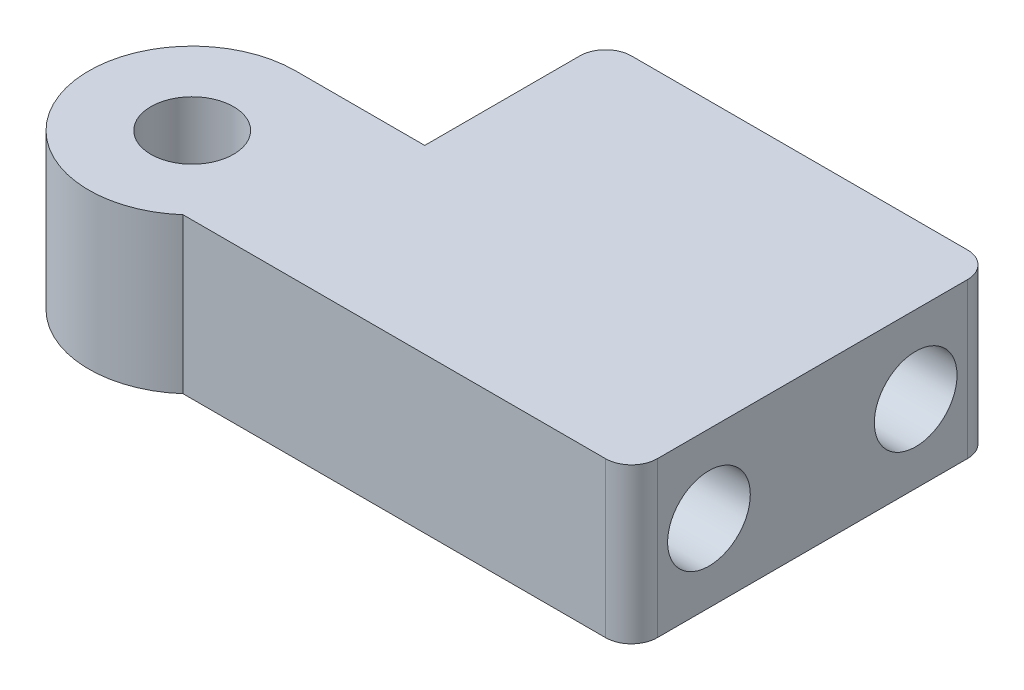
ISO-10303-21;
HEADER;
FILE_DESCRIPTION(('STEP AP214'),'2;1');
FILE_NAME('part.step','',(''),(''),'','','');
FILE_SCHEMA(('AUTOMOTIVE_DESIGN { 1 0 10303 214 1 1 1 1 }'));
ENDSEC;
DATA;
#1=APPLICATION_CONTEXT('core data for automotive mechanical design processes');
#2=APPLICATION_PROTOCOL_DEFINITION('international standard','automotive_design',2000,#1);
#3=PRODUCT_CONTEXT('',#1,'mechanical');
#4=PRODUCT('Part','Part','',(#3));
#5=PRODUCT_RELATED_PRODUCT_CATEGORY('part','',(#4));
#6=PRODUCT_DEFINITION_FORMATION('','',#4);
#7=PRODUCT_DEFINITION_CONTEXT('part definition',#1,'design');
#8=PRODUCT_DEFINITION('design','',#6,#7);
#9=PRODUCT_DEFINITION_SHAPE('','',#8);
#10=(LENGTH_UNIT() NAMED_UNIT(*) SI_UNIT(.MILLI.,.METRE.));
#11=(NAMED_UNIT(*) PLANE_ANGLE_UNIT() SI_UNIT($,.RADIAN.));
#12=(NAMED_UNIT(*) SI_UNIT($,.STERADIAN.) SOLID_ANGLE_UNIT());
#13=UNCERTAINTY_MEASURE_WITH_UNIT(LENGTH_MEASURE(1.E-05),#10,'distance_accuracy_value','');
#14=(GEOMETRIC_REPRESENTATION_CONTEXT(3) GLOBAL_UNCERTAINTY_ASSIGNED_CONTEXT((#13)) GLOBAL_UNIT_ASSIGNED_CONTEXT((#10,
#11,#12)) REPRESENTATION_CONTEXT('',''));
#15=CARTESIAN_POINT('',(0.,0.,0.));
#16=DIRECTION('',(0.,0.,1.));
#17=DIRECTION('',(1.,0.,0.));
#18=AXIS2_PLACEMENT_3D('',#15,#16,#17);
#19=CARTESIAN_POINT('',(20.,6.,0.));
#20=DIRECTION('',(1.,0.,0.));
#21=DIRECTION('',(0.,0.,-1.));
#22=AXIS2_PLACEMENT_3D('',#19,#20,#21);
#23=PLANE('',#22);
#24=CARTESIAN_POINT('',(20.,3.,0.));
#25=DIRECTION('',(1.,0.,0.));
#26=DIRECTION('',(0.,0.,-1.));
#27=AXIS2_PLACEMENT_3D('',#24,#25,#26);
#28=CIRCLE('',#27,1.6);
#29=CARTESIAN_POINT('',(20.,3.,-1.6));
#30=VERTEX_POINT('',#29);
#31=EDGE_CURVE('E208',#30,#30,#28,.T.);
#32=ORIENTED_EDGE('',*,*,#31,.F.);
#33=EDGE_LOOP('',(#32));
#34=FACE_BOUND('',#33,.T.);
#35=CARTESIAN_POINT('',(20.,3.,-8.));
#36=DIRECTION('',(1.,0.,0.));
#37=DIRECTION('',(0.,0.,-1.));
#38=AXIS2_PLACEMENT_3D('',#35,#36,#37);
#39=CIRCLE('',#38,1.6);
#40=CARTESIAN_POINT('',(20.,3.,-9.6));
#41=VERTEX_POINT('',#40);
#42=EDGE_CURVE('E202',#41,#41,#39,.T.);
#43=ORIENTED_EDGE('',*,*,#42,.F.);
#44=EDGE_LOOP('',(#43));
#45=FACE_BOUND('',#44,.T.);
#46=DIRECTION('',(0.,0.,1.));
#47=VECTOR('',#46,1.);
#48=CARTESIAN_POINT('',(20.,6.,0.));
#49=LINE('',#48,#47);
#50=CARTESIAN_POINT('',(20.,6.,-10.));
#51=VERTEX_POINT('',#50);
#52=CARTESIAN_POINT('',(20.,6.,2.));
#53=VERTEX_POINT('',#52);
#54=EDGE_CURVE('E161',#51,#53,#49,.T.);
#55=ORIENTED_EDGE('',*,*,#54,.T.);
#56=DIRECTION('',(0.,-1.,0.));
#57=VECTOR('',#56,1.);
#58=CARTESIAN_POINT('',(20.,0.,2.));
#59=LINE('',#58,#57);
#60=CARTESIAN_POINT('',(20.,0.,2.));
#61=VERTEX_POINT('',#60);
#62=EDGE_CURVE('E43',#53,#61,#59,.T.);
#63=ORIENTED_EDGE('',*,*,#62,.T.);
#64=DIRECTION('',(0.,0.,1.));
#65=VECTOR('',#64,1.);
#66=CARTESIAN_POINT('',(20.,0.,0.));
#67=LINE('',#66,#65);
#68=CARTESIAN_POINT('',(20.,0.,-10.));
#69=VERTEX_POINT('',#68);
#70=EDGE_CURVE('E144',#69,#61,#67,.T.);
#71=ORIENTED_EDGE('',*,*,#70,.F.);
#72=DIRECTION('',(0.,-1.,0.));
#73=VECTOR('',#72,1.);
#74=CARTESIAN_POINT('',(20.,6.,-10.));
#75=LINE('',#74,#73);
#76=EDGE_CURVE('E181',#69,#51,#75,.F.);
#77=ORIENTED_EDGE('',*,*,#76,.T.);
#78=EDGE_LOOP('',(#55,#63,#71,#77));
#79=FACE_BOUND('',#78,.T.);
#80=ADVANCED_FACE('F35',(#34,#45,#79),#23,.T.);
#81=CARTESIAN_POINT('',(0.,6.,-11.));
#82=DIRECTION('',(0.,0.,-1.));
#83=DIRECTION('',(-1.,0.,0.));
#84=AXIS2_PLACEMENT_3D('',#81,#82,#83);
#85=PLANE('',#84);
#86=DIRECTION('',(1.,0.,0.));
#87=VECTOR('',#86,1.);
#88=CARTESIAN_POINT('',(0.,0.,-11.));
#89=LINE('',#88,#87);
#90=CARTESIAN_POINT('',(6.,0.,-11.));
#91=VERTEX_POINT('',#90);
#92=CARTESIAN_POINT('',(19.,0.,-11.));
#93=VERTEX_POINT('',#92);
#94=EDGE_CURVE('E147',#91,#93,#89,.T.);
#95=ORIENTED_EDGE('',*,*,#94,.F.);
#96=DIRECTION('',(0.,-1.,0.));
#97=VECTOR('',#96,1.);
#98=CARTESIAN_POINT('',(6.,6.,-11.));
#99=LINE('',#98,#97);
#100=CARTESIAN_POINT('',(6.,6.,-11.));
#101=VERTEX_POINT('',#100);
#102=EDGE_CURVE('E175',#91,#101,#99,.F.);
#103=ORIENTED_EDGE('',*,*,#102,.T.);
#104=DIRECTION('',(1.,0.,0.));
#105=VECTOR('',#104,1.);
#106=CARTESIAN_POINT('',(0.,6.,-11.));
#107=LINE('',#106,#105);
#108=CARTESIAN_POINT('',(19.,6.,-11.));
#109=VERTEX_POINT('',#108);
#110=EDGE_CURVE('E118',#101,#109,#107,.T.);
#111=ORIENTED_EDGE('',*,*,#110,.T.);
#112=DIRECTION('',(0.,-1.,0.));
#113=VECTOR('',#112,1.);
#114=CARTESIAN_POINT('',(19.,6.,-11.));
#115=LINE('',#114,#113);
#116=EDGE_CURVE('E172',#109,#93,#115,.T.);
#117=ORIENTED_EDGE('',*,*,#116,.T.);
#118=EDGE_LOOP('',(#95,#103,#111,#117));
#119=FACE_BOUND('',#118,.T.);
#120=ADVANCED_FACE('F198',(#119),#85,.T.);
#121=CARTESIAN_POINT('',(5.,6.,0.));
#122=DIRECTION('',(1.,0.,0.));
#123=DIRECTION('',(0.,0.,-1.));
#124=AXIS2_PLACEMENT_3D('',#121,#122,#123);
#125=PLANE('',#124);
#126=DIRECTION('',(0.,0.,1.));
#127=VECTOR('',#126,1.);
#128=CARTESIAN_POINT('',(5.,6.,0.));
#129=LINE('',#128,#127);
#130=CARTESIAN_POINT('',(5.,6.,-10.));
#131=VERTEX_POINT('',#130);
#132=CARTESIAN_POINT('',(5.,6.,-4.));
#133=VERTEX_POINT('',#132);
#134=EDGE_CURVE('E105',#131,#133,#129,.T.);
#135=ORIENTED_EDGE('',*,*,#134,.F.);
#136=DIRECTION('',(0.,-1.,0.));
#137=VECTOR('',#136,1.);
#138=CARTESIAN_POINT('',(5.,0.,-10.));
#139=LINE('',#138,#137);
#140=CARTESIAN_POINT('',(5.,0.,-10.));
#141=VERTEX_POINT('',#140);
#142=EDGE_CURVE('E127',#131,#141,#139,.T.);
#143=ORIENTED_EDGE('',*,*,#142,.T.);
#144=DIRECTION('',(0.,0.,1.));
#145=VECTOR('',#144,1.);
#146=CARTESIAN_POINT('',(5.,0.,0.));
#147=LINE('',#146,#145);
#148=CARTESIAN_POINT('',(5.,0.,-4.));
#149=VERTEX_POINT('',#148);
#150=EDGE_CURVE('E124',#141,#149,#147,.T.);
#151=ORIENTED_EDGE('',*,*,#150,.T.);
#152=DIRECTION('',(0.,-1.,0.));
#153=VECTOR('',#152,1.);
#154=CARTESIAN_POINT('',(5.,6.,-4.));
#155=LINE('',#154,#153);
#156=EDGE_CURVE('E121',#133,#149,#155,.T.);
#157=ORIENTED_EDGE('',*,*,#156,.F.);
#158=EDGE_LOOP('',(#135,#143,#151,#157));
#159=FACE_BOUND('',#158,.T.);
#160=ADVANCED_FACE('F122',(#159),#125,.F.);
#161=CARTESIAN_POINT('',(0.,6.,-4.));
#162=DIRECTION('',(0.,0.,1.));
#163=DIRECTION('',(1.,0.,0.));
#164=AXIS2_PLACEMENT_3D('',#161,#162,#163);
#165=PLANE('',#164);
#166=DIRECTION('',(-1.,0.,0.));
#167=VECTOR('',#166,1.);
#168=CARTESIAN_POINT('',(0.,0.,-4.));
#169=LINE('',#168,#167);
#170=CARTESIAN_POINT('',(0.,0.,-4.));
#171=VERTEX_POINT('',#170);
#172=EDGE_CURVE('E152',#149,#171,#169,.T.);
#173=ORIENTED_EDGE('',*,*,#172,.T.);
#174=DIRECTION('',(0.,-1.,0.));
#175=VECTOR('',#174,1.);
#176=CARTESIAN_POINT('',(0.,6.,-4.));
#177=LINE('',#176,#175);
#178=CARTESIAN_POINT('',(0.,6.,-4.));
#179=VERTEX_POINT('',#178);
#180=EDGE_CURVE('E128',#179,#171,#177,.T.);
#181=ORIENTED_EDGE('',*,*,#180,.F.);
#182=DIRECTION('',(-1.,0.,0.));
#183=VECTOR('',#182,1.);
#184=CARTESIAN_POINT('',(0.,6.,-4.));
#185=LINE('',#184,#183);
#186=EDGE_CURVE('E111',#133,#179,#185,.T.);
#187=ORIENTED_EDGE('',*,*,#186,.F.);
#188=ORIENTED_EDGE('',*,*,#156,.T.);
#189=EDGE_LOOP('',(#173,#181,#187,#188));
#190=FACE_BOUND('',#189,.T.);
#191=ADVANCED_FACE('F130',(#190),#165,.F.);
#192=CARTESIAN_POINT('',(0.,6.,0.));
#193=DIRECTION('',(0.,-1.,0.));
#194=DIRECTION('',(0.,0.,-1.));
#195=AXIS2_PLACEMENT_3D('',#192,#193,#194);
#196=CYLINDRICAL_SURFACE('',#195,4.);
#197=CARTESIAN_POINT('',(0.,0.,0.));
#198=DIRECTION('',(0.,1.,0.));
#199=DIRECTION('',(0.,0.,1.));
#200=AXIS2_PLACEMENT_3D('',#197,#198,#199);
#201=CIRCLE('',#200,4.);
#202=CARTESIAN_POINT('',(2.64575131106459,0.,3.));
#203=VERTEX_POINT('',#202);
#204=EDGE_CURVE('E154',#171,#203,#201,.T.);
#205=ORIENTED_EDGE('',*,*,#204,.T.);
#206=DIRECTION('',(0.,-1.,0.));
#207=VECTOR('',#206,1.);
#208=CARTESIAN_POINT('',(2.64575131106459,6.,3.));
#209=LINE('',#208,#207);
#210=CARTESIAN_POINT('',(2.64575131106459,6.,3.));
#211=VERTEX_POINT('',#210);
#212=EDGE_CURVE('E143',#211,#203,#209,.T.);
#213=ORIENTED_EDGE('',*,*,#212,.F.);
#214=CARTESIAN_POINT('',(0.,6.,0.));
#215=DIRECTION('',(0.,1.,0.));
#216=DIRECTION('',(0.,0.,1.));
#217=AXIS2_PLACEMENT_3D('',#214,#215,#216);
#218=CIRCLE('',#217,4.);
#219=EDGE_CURVE('E133',#179,#211,#218,.T.);
#220=ORIENTED_EDGE('',*,*,#219,.F.);
#221=ORIENTED_EDGE('',*,*,#180,.T.);
#222=EDGE_LOOP('',(#205,#213,#220,#221));
#223=FACE_BOUND('',#222,.T.);
#224=ADVANCED_FACE('F250',(#223),#196,.T.);
#225=CARTESIAN_POINT('',(0.,6.,3.));
#226=DIRECTION('',(0.,0.,-1.));
#227=DIRECTION('',(-1.,0.,0.));
#228=AXIS2_PLACEMENT_3D('',#225,#226,#227);
#229=PLANE('',#228);
#230=DIRECTION('',(1.,0.,0.));
#231=VECTOR('',#230,1.);
#232=CARTESIAN_POINT('',(0.,0.,3.));
#233=LINE('',#232,#231);
#234=CARTESIAN_POINT('',(19.,0.,3.));
#235=VERTEX_POINT('',#234);
#236=EDGE_CURVE('E156',#203,#235,#233,.T.);
#237=ORIENTED_EDGE('',*,*,#236,.T.);
#238=DIRECTION('',(0.,-1.,0.));
#239=VECTOR('',#238,1.);
#240=CARTESIAN_POINT('',(19.,6.,3.));
#241=LINE('',#240,#239);
#242=CARTESIAN_POINT('',(19.,6.,3.));
#243=VERTEX_POINT('',#242);
#244=EDGE_CURVE('E11',#235,#243,#241,.F.);
#245=ORIENTED_EDGE('',*,*,#244,.T.);
#246=DIRECTION('',(1.,0.,0.));
#247=VECTOR('',#246,1.);
#248=CARTESIAN_POINT('',(0.,6.,3.));
#249=LINE('',#248,#247);
#250=EDGE_CURVE('E135',#211,#243,#249,.T.);
#251=ORIENTED_EDGE('',*,*,#250,.F.);
#252=ORIENTED_EDGE('',*,*,#212,.T.);
#253=EDGE_LOOP('',(#237,#245,#251,#252));
#254=FACE_BOUND('',#253,.T.);
#255=ADVANCED_FACE('F246',(#254),#229,.F.);
#256=CARTESIAN_POINT('',(0.,6.,0.));
#257=DIRECTION('',(0.,-1.,0.));
#258=DIRECTION('',(0.,0.,-1.));
#259=AXIS2_PLACEMENT_3D('',#256,#257,#258);
#260=CYLINDRICAL_SURFACE('',#259,1.6);
#261=CARTESIAN_POINT('',(0.,6.,0.));
#262=DIRECTION('',(0.,1.,0.));
#263=DIRECTION('',(0.,0.,1.));
#264=AXIS2_PLACEMENT_3D('',#261,#262,#263);
#265=CIRCLE('',#264,1.6);
#266=CARTESIAN_POINT('',(0.,6.,1.6));
#267=VERTEX_POINT('',#266);
#268=EDGE_CURVE('E140',#267,#267,#265,.T.);
#269=ORIENTED_EDGE('',*,*,#268,.T.);
#270=EDGE_LOOP('',(#269));
#271=FACE_BOUND('',#270,.T.);
#272=CARTESIAN_POINT('',(0.,0.,0.));
#273=DIRECTION('',(0.,1.,0.));
#274=DIRECTION('',(0.,0.,1.));
#275=AXIS2_PLACEMENT_3D('',#272,#273,#274);
#276=CIRCLE('',#275,1.6);
#277=CARTESIAN_POINT('',(0.,0.,1.6));
#278=VERTEX_POINT('',#277);
#279=EDGE_CURVE('E158',#278,#278,#276,.T.);
#280=ORIENTED_EDGE('',*,*,#279,.F.);
#281=EDGE_LOOP('',(#280));
#282=FACE_BOUND('',#281,.T.);
#283=ADVANCED_FACE('F242',(#271,#282),#260,.F.);
#284=CARTESIAN_POINT('',(0.,6.,0.));
#285=DIRECTION('',(0.,1.,0.));
#286=DIRECTION('',(0.,0.,1.));
#287=AXIS2_PLACEMENT_3D('',#284,#285,#286);
#288=PLANE('',#287);
#289=ORIENTED_EDGE('',*,*,#110,.F.);
#290=CARTESIAN_POINT('',(6.,6.,-10.));
#291=DIRECTION('',(0.,1.,0.));
#292=DIRECTION('',(0.,0.,1.));
#293=AXIS2_PLACEMENT_3D('',#290,#291,#292);
#294=CIRCLE('',#293,1.);
#295=EDGE_CURVE('E114',#101,#131,#294,.T.);
#296=ORIENTED_EDGE('',*,*,#295,.T.);
#297=ORIENTED_EDGE('',*,*,#134,.T.);
#298=ORIENTED_EDGE('',*,*,#186,.T.);
#299=ORIENTED_EDGE('',*,*,#219,.T.);
#300=ORIENTED_EDGE('',*,*,#250,.T.);
#301=CARTESIAN_POINT('',(19.,6.,2.));
#302=DIRECTION('',(0.,1.,0.));
#303=DIRECTION('',(0.,0.,1.));
#304=AXIS2_PLACEMENT_3D('',#301,#302,#303);
#305=CIRCLE('',#304,1.);
#306=EDGE_CURVE('E55',#243,#53,#305,.T.);
#307=ORIENTED_EDGE('',*,*,#306,.T.);
#308=ORIENTED_EDGE('',*,*,#54,.F.);
#309=CARTESIAN_POINT('',(19.,6.,-10.));
#310=DIRECTION('',(0.,1.,0.));
#311=DIRECTION('',(0.,0.,1.));
#312=AXIS2_PLACEMENT_3D('',#309,#310,#311);
#313=CIRCLE('',#312,1.);
#314=EDGE_CURVE('E177',#51,#109,#313,.T.);
#315=ORIENTED_EDGE('',*,*,#314,.T.);
#316=EDGE_LOOP('',(#289,#296,#297,#298,#299,#300,#307,#308,#315));
#317=FACE_BOUND('',#316,.T.);
#318=ORIENTED_EDGE('',*,*,#268,.F.);
#319=EDGE_LOOP('',(#318));
#320=FACE_BOUND('',#319,.T.);
#321=ADVANCED_FACE('F108',(#317,#320),#288,.T.);
#322=CARTESIAN_POINT('',(0.,0.,0.));
#323=DIRECTION('',(0.,1.,0.));
#324=DIRECTION('',(0.,0.,1.));
#325=AXIS2_PLACEMENT_3D('',#322,#323,#324);
#326=PLANE('',#325);
#327=ORIENTED_EDGE('',*,*,#150,.F.);
#328=CARTESIAN_POINT('',(6.,0.,-10.));
#329=DIRECTION('',(0.,1.,0.));
#330=DIRECTION('',(0.,0.,1.));
#331=AXIS2_PLACEMENT_3D('',#328,#329,#330);
#332=CIRCLE('',#331,1.);
#333=EDGE_CURVE('E170',#141,#91,#332,.F.);
#334=ORIENTED_EDGE('',*,*,#333,.T.);
#335=ORIENTED_EDGE('',*,*,#94,.T.);
#336=CARTESIAN_POINT('',(19.,0.,-10.));
#337=DIRECTION('',(0.,1.,0.));
#338=DIRECTION('',(0.,0.,1.));
#339=AXIS2_PLACEMENT_3D('',#336,#337,#338);
#340=CIRCLE('',#339,1.);
#341=EDGE_CURVE('E166',#93,#69,#340,.F.);
#342=ORIENTED_EDGE('',*,*,#341,.T.);
#343=ORIENTED_EDGE('',*,*,#70,.T.);
#344=CARTESIAN_POINT('',(19.,0.,2.));
#345=DIRECTION('',(0.,1.,0.));
#346=DIRECTION('',(0.,0.,1.));
#347=AXIS2_PLACEMENT_3D('',#344,#345,#346);
#348=CIRCLE('',#347,1.);
#349=EDGE_CURVE('E168',#61,#235,#348,.F.);
#350=ORIENTED_EDGE('',*,*,#349,.T.);
#351=ORIENTED_EDGE('',*,*,#236,.F.);
#352=ORIENTED_EDGE('',*,*,#204,.F.);
#353=ORIENTED_EDGE('',*,*,#172,.F.);
#354=EDGE_LOOP('',(#327,#334,#335,#342,#343,#350,#351,#352,#353));
#355=FACE_BOUND('',#354,.T.);
#356=ORIENTED_EDGE('',*,*,#279,.T.);
#357=EDGE_LOOP('',(#356));
#358=FACE_BOUND('',#357,.T.);
#359=ADVANCED_FACE('F189',(#355,#358),#326,.F.);
#360=CARTESIAN_POINT('',(9.99999999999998,3.,-8.));
#361=DIRECTION('',(1.,0.,0.));
#362=DIRECTION('',(0.,0.,-1.));
#363=AXIS2_PLACEMENT_3D('',#360,#361,#362);
#364=CYLINDRICAL_SURFACE('',#363,1.6);
#365=CARTESIAN_POINT('',(9.99999999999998,3.,-8.));
#366=DIRECTION('',(1.,0.,0.));
#367=DIRECTION('',(0.,0.,-1.));
#368=AXIS2_PLACEMENT_3D('',#365,#366,#367);
#369=CIRCLE('',#368,1.6);
#370=CARTESIAN_POINT('',(9.99999999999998,3.,-9.6));
#371=VERTEX_POINT('',#370);
#372=EDGE_CURVE('E148',#371,#371,#369,.T.);
#373=ORIENTED_EDGE('',*,*,#372,.F.);
#374=EDGE_LOOP('',(#373));
#375=FACE_BOUND('',#374,.T.);
#376=ORIENTED_EDGE('',*,*,#42,.T.);
#377=EDGE_LOOP('',(#376));
#378=FACE_BOUND('',#377,.T.);
#379=ADVANCED_FACE('F228',(#375,#378),#364,.F.);
#380=CARTESIAN_POINT('',(9.99999999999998,3.,-8.));
#381=DIRECTION('',(1.,0.,0.));
#382=DIRECTION('',(0.,0.,-1.));
#383=AXIS2_PLACEMENT_3D('',#380,#381,#382);
#384=PLANE('',#383);
#385=ORIENTED_EDGE('',*,*,#372,.T.);
#386=EDGE_LOOP('',(#385));
#387=FACE_BOUND('',#386,.T.);
#388=ADVANCED_FACE('F219',(#387),#384,.T.);
#389=CARTESIAN_POINT('',(9.99999999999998,3.,0.));
#390=DIRECTION('',(1.,0.,0.));
#391=DIRECTION('',(0.,0.,-1.));
#392=AXIS2_PLACEMENT_3D('',#389,#390,#391);
#393=CYLINDRICAL_SURFACE('',#392,1.6);
#394=CARTESIAN_POINT('',(9.99999999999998,3.,0.));
#395=DIRECTION('',(1.,0.,0.));
#396=DIRECTION('',(0.,0.,-1.));
#397=AXIS2_PLACEMENT_3D('',#394,#395,#396);
#398=CIRCLE('',#397,1.6);
#399=CARTESIAN_POINT('',(9.99999999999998,3.,-1.6));
#400=VERTEX_POINT('',#399);
#401=EDGE_CURVE('E205',#400,#400,#398,.T.);
#402=ORIENTED_EDGE('',*,*,#401,.F.);
#403=EDGE_LOOP('',(#402));
#404=FACE_BOUND('',#403,.T.);
#405=ORIENTED_EDGE('',*,*,#31,.T.);
#406=EDGE_LOOP('',(#405));
#407=FACE_BOUND('',#406,.T.);
#408=ADVANCED_FACE('F216',(#404,#407),#393,.F.);
#409=CARTESIAN_POINT('',(9.99999999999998,3.,0.));
#410=DIRECTION('',(1.,0.,0.));
#411=DIRECTION('',(0.,0.,-1.));
#412=AXIS2_PLACEMENT_3D('',#409,#410,#411);
#413=PLANE('',#412);
#414=ORIENTED_EDGE('',*,*,#401,.T.);
#415=EDGE_LOOP('',(#414));
#416=FACE_BOUND('',#415,.T.);
#417=ADVANCED_FACE('F214',(#416),#413,.T.);
#418=CARTESIAN_POINT('',(6.,6.,-10.));
#419=DIRECTION('',(0.,1.,0.));
#420=DIRECTION('',(0.,0.,1.));
#421=AXIS2_PLACEMENT_3D('',#418,#419,#420);
#422=CYLINDRICAL_SURFACE('',#421,1.);
#423=ORIENTED_EDGE('',*,*,#295,.F.);
#424=ORIENTED_EDGE('',*,*,#102,.F.);
#425=ORIENTED_EDGE('',*,*,#333,.F.);
#426=ORIENTED_EDGE('',*,*,#142,.F.);
#427=EDGE_LOOP('',(#423,#424,#425,#426));
#428=FACE_BOUND('',#427,.T.);
#429=ADVANCED_FACE('F260',(#428),#422,.T.);
#430=CARTESIAN_POINT('',(19.,6.,2.));
#431=DIRECTION('',(0.,1.,0.));
#432=DIRECTION('',(0.,0.,1.));
#433=AXIS2_PLACEMENT_3D('',#430,#431,#432);
#434=CYLINDRICAL_SURFACE('',#433,1.);
#435=ORIENTED_EDGE('',*,*,#306,.F.);
#436=ORIENTED_EDGE('',*,*,#244,.F.);
#437=ORIENTED_EDGE('',*,*,#349,.F.);
#438=ORIENTED_EDGE('',*,*,#62,.F.);
#439=EDGE_LOOP('',(#435,#436,#437,#438));
#440=FACE_BOUND('',#439,.T.);
#441=ADVANCED_FACE('F262',(#440),#434,.T.);
#442=CARTESIAN_POINT('',(19.,6.,-10.));
#443=DIRECTION('',(0.,-1.,0.));
#444=DIRECTION('',(0.,0.,-1.));
#445=AXIS2_PLACEMENT_3D('',#442,#443,#444);
#446=CYLINDRICAL_SURFACE('',#445,1.);
#447=ORIENTED_EDGE('',*,*,#314,.F.);
#448=ORIENTED_EDGE('',*,*,#76,.F.);
#449=ORIENTED_EDGE('',*,*,#341,.F.);
#450=ORIENTED_EDGE('',*,*,#116,.F.);
#451=EDGE_LOOP('',(#447,#448,#449,#450));
#452=FACE_BOUND('',#451,.T.);
#453=ADVANCED_FACE('F37',(#452),#446,.T.);
#454=CLOSED_SHELL('',(#80,#120,#160,#191,#224,#255,#283,#321,#359,#379,#388,#408,#417,#429,#441,#453));
#455=MANIFOLD_SOLID_BREP('B2',#454);
#456=ADVANCED_BREP_SHAPE_REPRESENTATION('',(#18,#455),#14);
#457=SHAPE_DEFINITION_REPRESENTATION(#9,#456);
ENDSEC;
END-ISO-10303-21;
